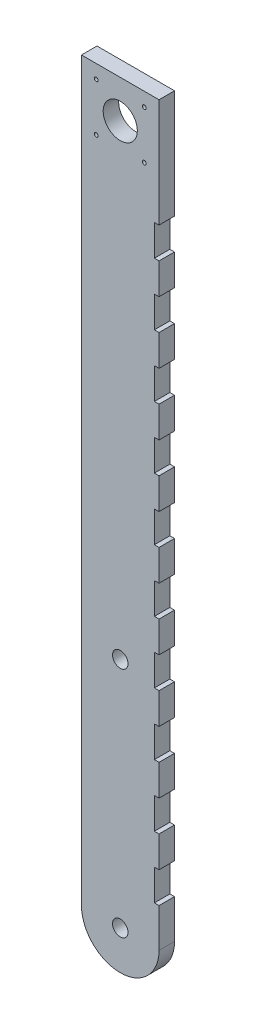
from build123d import *

# Parameters (mm, degrees)
SKETCH1_R           = 1.25
SKETCH1_R_2         = 11
SKETCH1_R_3         = 5
BOSS_EXTRUDE1_DEPTH = 10


with BuildPart() as part:
    # Sketch1 → Boss-Extrude1 (new body)
    with BuildSketch(Plane.XY):
        with BuildLine():
            Line((-25, 130), (25, 130))
            Line((25, 130), (25, 60))
            Line((25, 60), (22, 60))
            Line((22, 60), (22, 40))
            Line((22, 40), (25, 40))
            Line((25, 40), (25, 20))
            Line((25, 20), (22, 20))
            Line((22, 20), (22, 0))
            Line((22, 0), (25, 0))
            Line((25, 0), (25, -20))
            Line((25, -20), (22, -20))
            Line((22, -20), (22, -40))
            Line((22, -40), (25, -40))
            Line((25, -40), (25, -60))
            Line((25, -60), (22, -60))
            Line((22, -60), (22, -80))
            Line((22, -80), (25, -80))
            Line((25, -80), (25, -100))
            Line((25, -100), (22, -100))
            Line((22, -100), (22, -120))
            Line((22, -120), (25, -120))
            Line((25, -120), (25, -140))
            Line((25, -140), (22, -140))
            Line((22, -140), (22, -160))
            Line((22, -160), (25, -160))
            Line((25, -160), (25, -180))
            Line((25, -180), (22, -180))
            Line((22, -180), (22, -200))
            Line((22, -200), (25, -200))
            Line((25, -200), (25, -220))
            Line((25, -220), (22, -220))
            Line((22, -220), (22, -240))
            Line((22, -240), (25, -240))
            Line((25, -240), (25, -260))
            Line((25, -260), (22, -260))
            Line((22, -260), (22, -280))
            Line((22, -280), (25, -280))
            Line((25, -280), (25, -300))
            Line((25, -300), (22, -300))
            Line((22, -300), (22, -320))
            Line((22, -320), (25, -320))
            Line((25, -320), (25, -345))
            ThreePointArc((25, -345), (0, -370), (-25, -345))
            Line((-25, -345), (-25, 130))
        make_face()
        with Locations((-15.5, 121.163920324)):
            Circle(SKETCH1_R, mode=Mode.SUBTRACT)
        with Locations(Location((15.5, 121.163920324, 0), (0, 0, 180))):
            Circle(SKETCH1_R, mode=Mode.SUBTRACT)
        with Locations((15.5, 90.163920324)):
            Circle(SKETCH1_R, mode=Mode.SUBTRACT)
        with Locations(Location((-15.5, 90.163920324, 0), (0, 0, 180))):
            Circle(SKETCH1_R, mode=Mode.SUBTRACT)
        with Locations((0, 105.663920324)):
            Circle(SKETCH1_R_2, mode=Mode.SUBTRACT)
        with Locations((0, -195)):
            Circle(SKETCH1_R_3, mode=Mode.SUBTRACT)
        with Locations((0, -345)):
            Circle(SKETCH1_R_3, mode=Mode.SUBTRACT)
    extrude(amount=BOSS_EXTRUDE1_DEPTH)


solid = part.part
